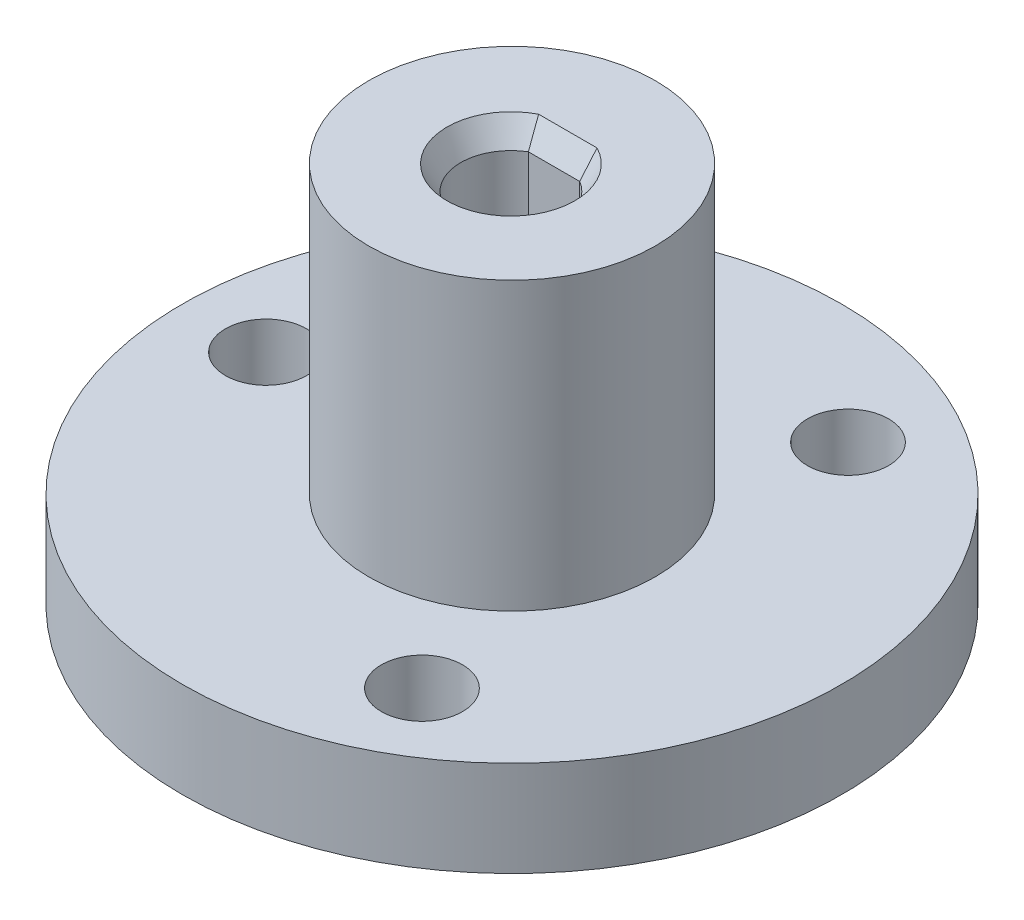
from build123d import *
from OCP.BRepFilletAPI import BRepFilletAPI_MakeChamfer

# Parameters (mm, degrees)
ESQUISSE1_R        = 13.8
ESQUISSE1_R_2      = 1.7
ESQUISSE1_R_3      = 6
BOSS_EXTRU_1_DEPTH = 4
ESQUISSE1_3_R      = 6
BOSS_EXTRU_2_DEPTH = 16
CHANFREIN1_SIZE    = 1
CHANFREIN1_SIZE2   = 0.577350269


with BuildPart() as part:
    # Esquisse1 → Boss.-Extru.1 (new body)
    with BuildSketch(Plane(origin=(0, 0, 0), x_dir=(1, 0, 0), z_dir=(0, 1, 0))):
        with Locations(Location((0, 0, 0), (0, 0, 270))):
            Circle(ESQUISSE1_R)
        with Locations(Location((5.15, -8.920061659, 0), (0, 0, 270))):
            Circle(ESQUISSE1_R_2, mode=Mode.SUBTRACT)
        with Locations(Location((5.15, 8.920061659, 0), (0, 0, 270))):
            Circle(ESQUISSE1_R_2, mode=Mode.SUBTRACT)
        with Locations(Location((-10.3, 0, 0), (0, 0, 270))):
            Circle(ESQUISSE1_R_2, mode=Mode.SUBTRACT)
        with Locations(Location((0, 0, 0), (0, 0, 270))):
            Circle(ESQUISSE1_R_3, mode=Mode.SUBTRACT)
    extrude(amount=BOSS_EXTRU_1_DEPTH)

    # Esquisse1_3 → Boss.-Extru.2 (add)
    with BuildSketch(Plane(origin=(0, 0, 0), x_dir=(1, 0, 0), z_dir=(0, 1, 0))):
        with Locations(Location((0, 0, 0), (0, 0, 270))):
            Circle(ESQUISSE1_3_R)
        with BuildLine():
            Line((-1.073300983, 1.76), (1.073300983, 1.76))
            ThreePointArc((1.073300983, 1.76), (0, -2.145), (-1.073300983, 1.76))
        make_face(mode=Mode.SUBTRACT)
    extrude(amount=BOSS_EXTRU_2_DEPTH)

    # Chanfrein1: one chamfer whose edges measure the first distance from different faces: ONE call of the kernel's chamfer builder (chamfer() names one face for all edges)
    chanfrein1_edges_1 = [part.edges().sort_by_distance(p)[0] for p in [
        (0, 16, 2.145),
    ]]
    chanfrein1_side_1 = [part.faces().sort_by_distance(p)[0] for p in [
        (0, 8, 2.145),
    ]]
    chanfrein1_edges_2 = [part.edges().sort_by_distance(p)[0] for p in [
        (0, 16, -1.76),
    ]]
    chanfrein1_side_2 = [part.faces().sort_by_distance(p)[0] for p in [
        (0, 8, -1.76),
    ]]
    chanfrein1 = BRepFilletAPI_MakeChamfer(part.part.solid().wrapped)
    for e in chanfrein1_edges_1:
        chanfrein1.Add(CHANFREIN1_SIZE, CHANFREIN1_SIZE2, e.wrapped, chanfrein1_side_1[0].wrapped)  # the first distance lies on this face
    for e in chanfrein1_edges_2:
        chanfrein1.Add(CHANFREIN1_SIZE, CHANFREIN1_SIZE2, e.wrapped, chanfrein1_side_2[0].wrapped)  # the first distance lies on this face
    add(Compound.cast(chanfrein1.Shape()), mode=Mode.REPLACE)


solid = part.part
